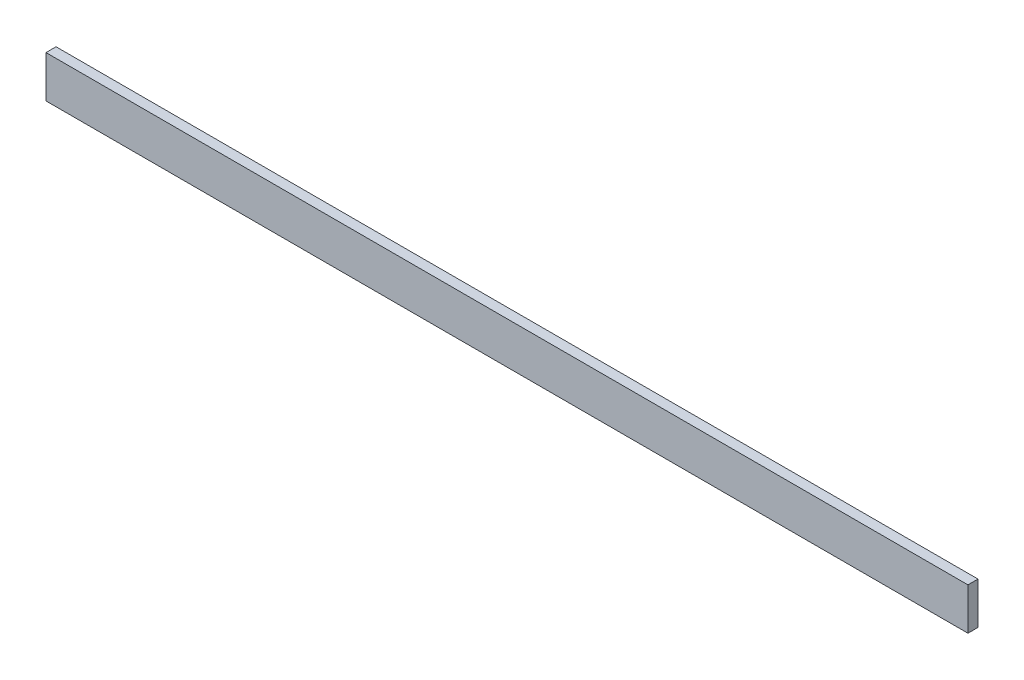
from build123d import *

# Parameters (mm, degrees)
SKETCH1_W           = 1100
SKETCH1_H           = 50
BOSS_EXTRUDE1_DEPTH = 12


with BuildPart() as part:
    # Sketch1 → Boss-Extrude1 (new body)
    with BuildSketch(Plane.XY):
        Rectangle(SKETCH1_W, SKETCH1_H)
    extrude(amount=BOSS_EXTRUDE1_DEPTH)


solid = part.part
